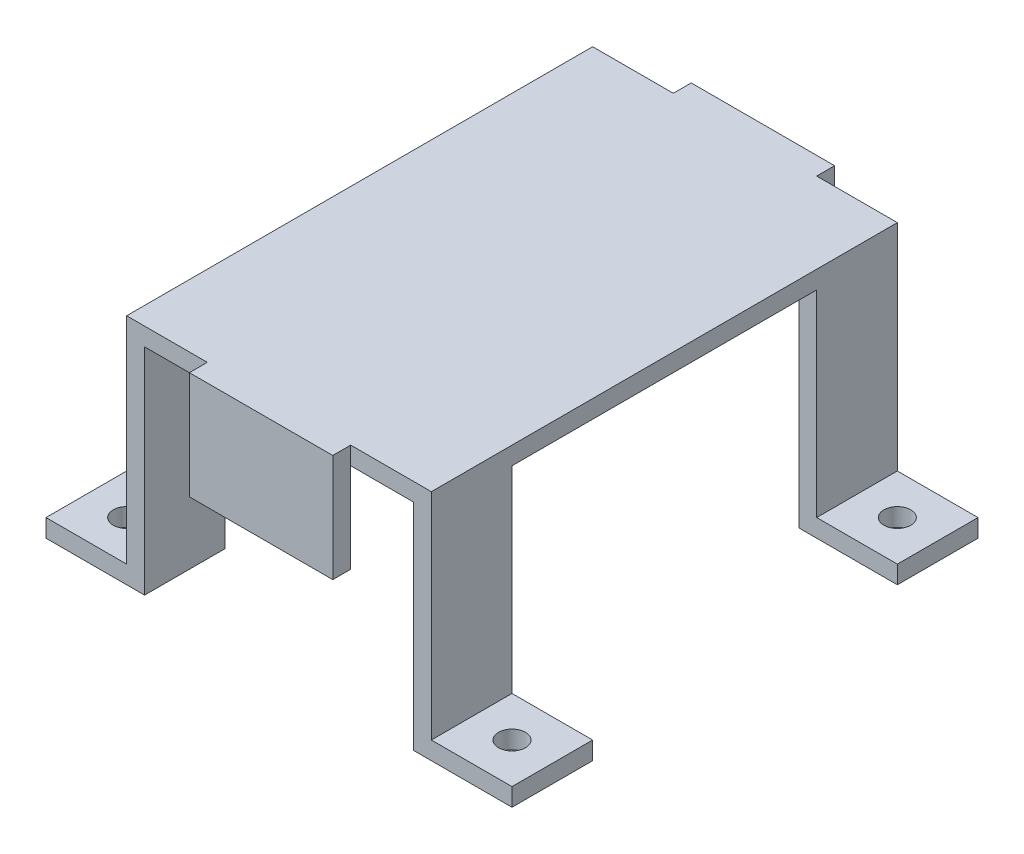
from build123d import *

# Parameters (mm, degrees)
SKETCH1_W           = 52
SKETCH1_H           = 52
BOSS_EXTRUDE2_DEPTH = 26
SKETCH2_W           = 30
SKETCH2_H           = 52
CUT_EXTRUDE1_DEPTH  = 24
SKETCH3_W           = 9
SKETCH3_H           = 52
CUT_EXTRUDE2_DEPTH  = 24
SKETCH4_R           = 1.5
CUT_EXTRUDE3_DEPTH  = 78.356318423
SKETCH5_W           = 34
SKETCH5_H           = 24
CUT_EXTRUDE4_DEPTH  = 79
SKETCH6_W           = 16
SKETCH6_H           = 2
BOSS_EXTRUDE3_DEPTH = 2
SKETCH7_W           = 16
SKETCH7_H           = 2
BOSS_EXTRUDE4_DEPTH = 10
SKETCH8_W           = 16
SKETCH8_H           = 2
BOSS_EXTRUDE5_DEPTH = 2
SKETCH9_W           = 16
SKETCH9_H           = 2
BOSS_EXTRUDE6_DEPTH = 10


with BuildPart() as part:
    # Sketch1 → Boss-Extrude2 (new body)
    with BuildSketch(Plane(origin=(0, 0, 0), x_dir=(1, 0, 0), z_dir=(0, 1, 0))):
        with Locations((26, 26)):
            Rectangle(SKETCH1_W, SKETCH1_H)
    extrude(amount=BOSS_EXTRUDE2_DEPTH)

    # Sketch2 → Cut-Extrude1 (cut)
    with BuildSketch(Plane(origin=(0, 0, 0), x_dir=(-1, 0, 0), z_dir=(0, -1, 0))):
        with Locations((-26, 26)):
            Rectangle(SKETCH2_W, SKETCH2_H)
    extrude(amount=-CUT_EXTRUDE1_DEPTH, mode=Mode.SUBTRACT)

    # Sketch3 → Cut-Extrude2 (cut)
    with BuildSketch(Plane(origin=(0, 26, 0), x_dir=(1, 0, 0), z_dir=(0, 1, 0))):
        with Locations((47.5, 26)):
            Rectangle(SKETCH3_W, SKETCH3_H)
        with Locations((4.5, 26)):
            Rectangle(SKETCH3_W, SKETCH3_H)
    extrude(amount=-CUT_EXTRUDE2_DEPTH, mode=Mode.SUBTRACT)

    # Sketch4 → Cut-Extrude3 (cut, through all)
    with BuildSketch(Plane(origin=(0, 2, 0), x_dir=(1, 0, 0), z_dir=(0, 1, 0))):
        with Locations(Location((47.5, 4.5, 0), (0, 0, 270))):
            Circle(SKETCH4_R)
        with Locations(Location((47.5, 47.5, 0), (0, 0, 270))):
            Circle(SKETCH4_R)
        with Locations(Location((4.5, 47.5, 0), (0, 0, 270))):
            Circle(SKETCH4_R)
        with Locations(Location((4.5, 4.5, 0), (0, 0, 270))):
            Circle(SKETCH4_R)
    extrude(amount=-CUT_EXTRUDE3_DEPTH, mode=Mode.SUBTRACT)

    # Sketch5 → Cut-Extrude4 (cut, through all)
    with BuildSketch(Plane(origin=(52, 0, 0), x_dir=(0, 0, -1), z_dir=(1, 0, 0))):
        with Locations((26, 12)):
            Rectangle(SKETCH5_W, SKETCH5_H)
    extrude(amount=-CUT_EXTRUDE4_DEPTH, mode=Mode.SUBTRACT)

    # Sketch6 → Boss-Extrude3 (add)
    with BuildSketch(Plane.XY):
        with Locations((26, 25)):
            Rectangle(SKETCH6_W, SKETCH6_H)
    extrude(amount=BOSS_EXTRUDE3_DEPTH)

    # Sketch7 → Boss-Extrude4 (add)
    with BuildSketch(Plane(origin=(0, 24, 0), x_dir=(-1, 0, 0), z_dir=(0, -1, 0))):
        with Locations((-26, -1)):
            Rectangle(SKETCH7_W, SKETCH7_H)
    extrude(amount=BOSS_EXTRUDE4_DEPTH)

    # Sketch8 → Boss-Extrude5 (add)
    with BuildSketch(Plane(origin=(0, 0, -52), x_dir=(-1, 0, 0), z_dir=(0, 0, -1))):
        with Locations((-26, 25)):
            Rectangle(SKETCH8_W, SKETCH8_H)
    extrude(amount=BOSS_EXTRUDE5_DEPTH)

    # Sketch9 → Boss-Extrude6 (add)
    with BuildSketch(Plane.XZ.offset(-24)):
        with Locations((26, -53)):
            Rectangle(SKETCH9_W, SKETCH9_H)
    extrude(amount=BOSS_EXTRUDE6_DEPTH)


solid = part.part
